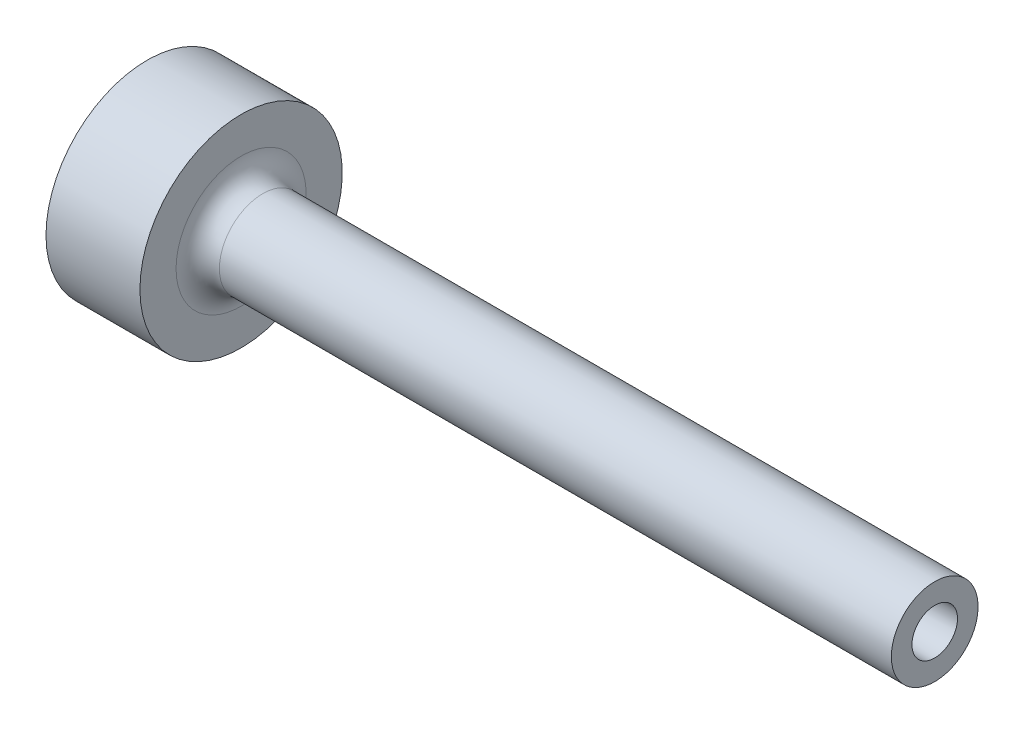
ISO-10303-21;
HEADER;
FILE_DESCRIPTION(('STEP AP214'),'2;1');
FILE_NAME('part.step','',(''),(''),'','','');
FILE_SCHEMA(('AUTOMOTIVE_DESIGN { 1 0 10303 214 1 1 1 1 }'));
ENDSEC;
DATA;
#1=APPLICATION_CONTEXT('core data for automotive mechanical design processes');
#2=APPLICATION_PROTOCOL_DEFINITION('international standard','automotive_design',2000,#1);
#3=PRODUCT_CONTEXT('',#1,'mechanical');
#4=PRODUCT('Part','Part','',(#3));
#5=PRODUCT_RELATED_PRODUCT_CATEGORY('part','',(#4));
#6=PRODUCT_DEFINITION_FORMATION('','',#4);
#7=PRODUCT_DEFINITION_CONTEXT('part definition',#1,'design');
#8=PRODUCT_DEFINITION('design','',#6,#7);
#9=PRODUCT_DEFINITION_SHAPE('','',#8);
#10=(LENGTH_UNIT() NAMED_UNIT(*) SI_UNIT(.MILLI.,.METRE.));
#11=(NAMED_UNIT(*) PLANE_ANGLE_UNIT() SI_UNIT($,.RADIAN.));
#12=(NAMED_UNIT(*) SI_UNIT($,.STERADIAN.) SOLID_ANGLE_UNIT());
#13=UNCERTAINTY_MEASURE_WITH_UNIT(LENGTH_MEASURE(1.E-05),#10,'distance_accuracy_value','');
#14=(GEOMETRIC_REPRESENTATION_CONTEXT(3) GLOBAL_UNCERTAINTY_ASSIGNED_CONTEXT((#13)) GLOBAL_UNIT_ASSIGNED_CONTEXT((#10,
#11,#12)) REPRESENTATION_CONTEXT('',''));
#15=CARTESIAN_POINT('',(0.,0.,0.));
#16=DIRECTION('',(0.,0.,1.));
#17=DIRECTION('',(1.,0.,0.));
#18=AXIS2_PLACEMENT_3D('',#15,#16,#17);
#19=CARTESIAN_POINT('',(0.,0.,0.));
#20=DIRECTION('',(-1.,0.,0.));
#21=DIRECTION('',(0.,0.,1.));
#22=AXIS2_PLACEMENT_3D('',#19,#20,#21);
#23=CYLINDRICAL_SURFACE('',#22,14.);
#24=CARTESIAN_POINT('',(13.,0.,0.));
#25=DIRECTION('',(-1.,0.,0.));
#26=DIRECTION('',(0.,0.,1.));
#27=AXIS2_PLACEMENT_3D('',#24,#25,#26);
#28=CIRCLE('',#27,14.);
#29=CARTESIAN_POINT('',(13.,0.,14.));
#30=VERTEX_POINT('',#29);
#31=EDGE_CURVE('E89',#30,#30,#28,.T.);
#32=ORIENTED_EDGE('',*,*,#31,.T.);
#33=EDGE_LOOP('',(#32));
#34=FACE_BOUND('',#33,.T.);
#35=CARTESIAN_POINT('',(0.,0.,0.));
#36=DIRECTION('',(-1.,0.,0.));
#37=DIRECTION('',(0.,0.,1.));
#38=AXIS2_PLACEMENT_3D('',#35,#36,#37);
#39=CIRCLE('',#38,14.);
#40=CARTESIAN_POINT('',(0.,0.,14.));
#41=VERTEX_POINT('',#40);
#42=EDGE_CURVE('E84',#41,#41,#39,.T.);
#43=ORIENTED_EDGE('',*,*,#42,.F.);
#44=EDGE_LOOP('',(#43));
#45=FACE_BOUND('',#44,.T.);
#46=CARTESIAN_POINT('',(6.5,-13.856406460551,-2.));
#47=CARTESIAN_POINT('',(6.61172417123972,-13.8564082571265,-1.99999534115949));
#48=CARTESIAN_POINT('',(6.72351471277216,-13.8577723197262,-1.99060664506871));
#49=CARTESIAN_POINT('',(6.9439746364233,-13.8630779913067,-1.95330740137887));
#50=CARTESIAN_POINT('',(7.05264079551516,-13.8670221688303,-1.92537839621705));
#51=CARTESIAN_POINT('',(7.26362870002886,-13.8770324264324,-1.85184738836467));
#52=CARTESIAN_POINT('',(7.36595507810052,-13.8830969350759,-1.80625847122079));
#53=CARTESIAN_POINT('',(7.56148972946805,-13.8966626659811,-1.69873175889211));
#54=CARTESIAN_POINT('',(7.65469934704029,-13.9041636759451,-1.63679637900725));
#55=CARTESIAN_POINT('',(7.83004829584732,-13.9198182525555,-1.49785346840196));
#56=CARTESIAN_POINT('',(7.91211171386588,-13.9279757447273,-1.42075056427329));
#57=CARTESIAN_POINT('',(8.06218155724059,-13.9439890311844,-1.25386707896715));
#58=CARTESIAN_POINT('',(8.13018723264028,-13.9518448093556,-1.16408582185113));
#59=CARTESIAN_POINT('',(8.25048909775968,-13.9664103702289,-0.973910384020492));
#60=CARTESIAN_POINT('',(8.30271571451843,-13.9731150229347,-0.873471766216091));
#61=CARTESIAN_POINT('',(8.38953073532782,-13.9845795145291,-0.665136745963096));
#62=CARTESIAN_POINT('',(8.4241199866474,-13.9893394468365,-0.557240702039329));
#63=CARTESIAN_POINT('',(8.47444920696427,-13.9963505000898,-0.337834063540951));
#64=CARTESIAN_POINT('',(8.49031606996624,-13.9986185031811,-0.226353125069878));
#65=CARTESIAN_POINT('',(8.5031438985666,-14.0004479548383,-0.00228956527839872));
#66=CARTESIAN_POINT('',(8.50010582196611,-14.0000095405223,0.110292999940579));
#67=CARTESIAN_POINT('',(8.47531062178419,-13.9964890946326,0.33249899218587));
#68=CARTESIAN_POINT('',(8.45369000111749,-13.9934263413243,0.442137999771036));
#69=CARTESIAN_POINT('',(8.39255744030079,-13.9850228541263,0.656215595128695));
#70=CARTESIAN_POINT('',(8.3530450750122,-13.9796820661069,0.760654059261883));
#71=CARTESIAN_POINT('',(8.25710925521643,-13.9672894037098,0.961781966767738));
#72=CARTESIAN_POINT('',(8.20062784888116,-13.9602316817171,1.05844339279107));
#73=CARTESIAN_POINT('',(8.07239950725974,-13.9451926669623,1.24096782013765));
#74=CARTESIAN_POINT('',(8.00065165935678,-13.9372113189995,1.32683017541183));
#75=CARTESIAN_POINT('',(7.843165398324,-13.921132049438,1.48612299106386));
#76=CARTESIAN_POINT('',(7.75730786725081,-13.9130337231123,1.55943569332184));
#77=CARTESIAN_POINT('',(7.57444547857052,-13.8977029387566,1.69062989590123));
#78=CARTESIAN_POINT('',(7.47744056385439,-13.890470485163,1.74851131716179));
#79=CARTESIAN_POINT('',(7.27491971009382,-13.8776905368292,1.84721301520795));
#80=CARTESIAN_POINT('',(7.1693981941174,-13.8721441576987,1.88802200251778));
#81=CARTESIAN_POINT('',(6.95290242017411,-13.8633846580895,1.9513062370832));
#82=CARTESIAN_POINT('',(6.84192850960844,-13.8601713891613,1.97378265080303));
#83=CARTESIAN_POINT('',(6.61872346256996,-13.8564698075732,1.99960390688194));
#84=CARTESIAN_POINT('',(6.50651197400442,-13.8559577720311,2.00311531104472));
#85=CARTESIAN_POINT('',(6.28310219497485,-13.8576537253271,1.9913480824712));
#86=CARTESIAN_POINT('',(6.17190387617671,-13.8598616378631,1.9760699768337));
#87=CARTESIAN_POINT('',(5.95418781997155,-13.8667269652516,1.92729837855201));
#88=CARTESIAN_POINT('',(5.84765127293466,-13.8713733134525,1.8938871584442));
#89=CARTESIAN_POINT('',(5.6416912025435,-13.8825829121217,1.80988306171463));
#90=CARTESIAN_POINT('',(5.54226800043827,-13.8891462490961,1.75928940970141));
#91=CARTESIAN_POINT('',(5.35260812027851,-13.9035064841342,1.64195360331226));
#92=CARTESIAN_POINT('',(5.26243903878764,-13.911311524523,1.57510320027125));
#93=CARTESIAN_POINT('',(5.09454027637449,-13.9272509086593,1.42730277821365));
#94=CARTESIAN_POINT('',(5.01681123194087,-13.9353852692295,1.34635203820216));
#95=CARTESIAN_POINT('',(4.8754047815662,-13.9511405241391,1.17191708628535));
#96=CARTESIAN_POINT('',(4.81183747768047,-13.9587570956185,1.07834317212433));
#97=CARTESIAN_POINT('',(4.70132443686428,-13.972552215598,0.881748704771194));
#98=CARTESIAN_POINT('',(4.65437828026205,-13.9787308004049,0.778728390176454));
#99=CARTESIAN_POINT('',(4.57861788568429,-13.9889347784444,0.566515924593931));
#100=CARTESIAN_POINT('',(4.54974241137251,-13.9929674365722,0.457345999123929));
#101=CARTESIAN_POINT('',(4.51074453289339,-13.9984555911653,0.235645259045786));
#102=CARTESIAN_POINT('',(4.50062101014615,-13.9999112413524,0.123114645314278));
#103=CARTESIAN_POINT('',(4.49943976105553,-14.0000800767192,-0.101043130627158));
#104=CARTESIAN_POINT('',(4.50821318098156,-13.998817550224,-0.212669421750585));
#105=CARTESIAN_POINT('',(4.54421615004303,-13.9937406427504,-0.432842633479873));
#106=CARTESIAN_POINT('',(4.57144565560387,-13.989926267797,-0.541389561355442));
#107=CARTESIAN_POINT('',(4.6435299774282,-13.9801722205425,-0.752283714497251));
#108=CARTESIAN_POINT('',(4.68837418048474,-13.9742338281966,-0.854634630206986));
#109=CARTESIAN_POINT('',(4.79439714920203,-13.960885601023,-1.05038570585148));
#110=CARTESIAN_POINT('',(4.8555763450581,-13.9534757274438,-1.14378562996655));
#111=CARTESIAN_POINT('',(4.99314771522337,-13.9379304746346,-1.31984194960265));
#112=CARTESIAN_POINT('',(5.06966490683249,-13.9297894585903,-1.40240016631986));
#113=CARTESIAN_POINT('',(5.2354775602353,-13.9137422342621,-1.55356716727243));
#114=CARTESIAN_POINT('',(5.32477602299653,-13.9058360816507,-1.6221726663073));
#115=CARTESIAN_POINT('',(5.51414543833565,-13.8911108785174,-1.74379523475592));
#116=CARTESIAN_POINT('',(5.61426869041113,-13.8842975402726,-1.79673154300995));
#117=CARTESIAN_POINT('',(5.82203229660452,-13.8725962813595,-1.88495902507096));
#118=CARTESIAN_POINT('',(5.92966459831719,-13.8677063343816,-1.92026877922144));
#119=CARTESIAN_POINT('',(6.11483642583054,-13.8615529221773,-1.96409255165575));
#120=CARTESIAN_POINT('',(6.19122433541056,-13.859633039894,-1.97753762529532));
#121=CARTESIAN_POINT('',(6.34506419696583,-13.857059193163,-1.99549291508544));
#122=CARTESIAN_POINT('',(6.42251613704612,-13.8564052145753,-2.00000323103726));
#123=CARTESIAN_POINT('',(6.5,-13.856406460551,-2.));
#124=B_SPLINE_CURVE_WITH_KNOTS('',3,(#46,#47,#48,#49,#50,#51,#52,#53,#54,#55,#56,#57,#58,#59,
#60,#61,#62,#63,#64,#65,#66,#67,#68,#69,#70,#71,#72,#73,#74,#75,#76,#77,#78,#79,#80,#81,#82,#83,
#84,#85,#86,#87,#88,#89,#90,#91,#92,#93,#94,#95,#96,#97,#98,#99,#100,#101,#102,#103,#104,#105,
#106,#107,#108,#109,#110,#111,#112,#113,#114,#115,#116,#117,#118,#119,#120,#121,#122,#123),
.UNSPECIFIED.,.T.,.F.,(4,2,2,2,2,2,2,2,2,2,2,2,2,2,2,2,2,2,2,2,2,2,2,2,2,2,2,2,2,2,2,2,2,2,2,2,
2,2,4),(0.,0.334889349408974,0.670112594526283,1.00508792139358,1.34001378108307,
1.6771171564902,2.01423851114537,2.35282530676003,2.6913958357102,3.02765822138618,
3.36390357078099,3.69769984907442,4.03150405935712,4.36646147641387,4.70143892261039,
5.03940517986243,5.37737316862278,5.7155642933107,6.05373389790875,6.3889286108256,
6.72411392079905,7.05779100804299,7.39148315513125,7.72746121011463,8.06345644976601,
8.40197921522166,8.74049343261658,9.07785422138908,9.41519488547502,9.74953375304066,
10.083871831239,10.4180087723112,10.7521545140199,11.0891434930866,11.426211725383,
11.7649881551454,12.103406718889,12.3356645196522,12.5679197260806),.UNSPECIFIED.);
#125=CARTESIAN_POINT('',(6.5,-13.856406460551,-2.));
#126=VERTEX_POINT('',#125);
#127=EDGE_CURVE('E10',#126,#126,#124,.T.);
#128=ORIENTED_EDGE('',*,*,#127,.F.);
#129=EDGE_LOOP('',(#128));
#130=FACE_BOUND('',#129,.T.);
#131=ADVANCED_FACE('F16',(#34,#45,#130),#23,.T.);
#132=CARTESIAN_POINT('',(0.,0.,0.));
#133=DIRECTION('',(1.,0.,0.));
#134=DIRECTION('',(0.,0.,-1.));
#135=AXIS2_PLACEMENT_3D('',#132,#133,#134);
#136=CONICAL_SURFACE('',#135,1.25,0.0174532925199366);
#137=CARTESIAN_POINT('',(109.,0.,0.));
#138=DIRECTION('',(-1.,0.,0.));
#139=DIRECTION('',(0.,0.,1.));
#140=AXIS2_PLACEMENT_3D('',#137,#138,#139);
#141=CIRCLE('',#140,3.15260207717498);
#142=CARTESIAN_POINT('',(109.,0.,3.15260207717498));
#143=VERTEX_POINT('',#142);
#144=EDGE_CURVE('E81',#143,#143,#141,.T.);
#145=ORIENTED_EDGE('',*,*,#144,.F.);
#146=EDGE_LOOP('',(#145));
#147=FACE_BOUND('',#146,.T.);
#148=CARTESIAN_POINT('',(0.924407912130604,0.,0.));
#149=DIRECTION('',(-1.,0.,0.));
#150=DIRECTION('',(0.,0.,1.));
#151=AXIS2_PLACEMENT_3D('',#148,#149,#150);
#152=CIRCLE('',#151,1.26613560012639);
#153=CARTESIAN_POINT('',(0.924407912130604,0.,1.26613560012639));
#154=VERTEX_POINT('',#153);
#155=EDGE_CURVE('E94',#154,#154,#152,.F.);
#156=ORIENTED_EDGE('',*,*,#155,.F.);
#157=EDGE_LOOP('',(#156));
#158=FACE_BOUND('',#157,.T.);
#159=ADVANCED_FACE('F45',(#147,#158),#136,.F.);
#160=CARTESIAN_POINT('',(16.,0.,0.));
#161=DIRECTION('',(-1.,0.,0.));
#162=DIRECTION('',(0.,0.,1.));
#163=AXIS2_PLACEMENT_3D('',#160,#161,#162);
#164=TOROIDAL_SURFACE('',#163,9.,3.);
#165=CARTESIAN_POINT('',(13.,0.,0.));
#166=DIRECTION('',(-1.,0.,0.));
#167=DIRECTION('',(0.,0.,1.));
#168=AXIS2_PLACEMENT_3D('',#165,#166,#167);
#169=CIRCLE('',#168,9.);
#170=CARTESIAN_POINT('',(13.,0.,9.));
#171=VERTEX_POINT('',#170);
#172=EDGE_CURVE('E91',#171,#171,#169,.T.);
#173=ORIENTED_EDGE('',*,*,#172,.F.);
#174=EDGE_LOOP('',(#173));
#175=FACE_BOUND('',#174,.T.);
#176=CARTESIAN_POINT('',(16.,0.,0.));
#177=DIRECTION('',(-1.,0.,0.));
#178=DIRECTION('',(0.,0.,1.));
#179=AXIS2_PLACEMENT_3D('',#176,#177,#178);
#180=CIRCLE('',#179,6.);
#181=CARTESIAN_POINT('',(16.,0.,6.));
#182=VERTEX_POINT('',#181);
#183=EDGE_CURVE('E28',#182,#182,#180,.T.);
#184=ORIENTED_EDGE('',*,*,#183,.T.);
#185=EDGE_LOOP('',(#184));
#186=FACE_BOUND('',#185,.T.);
#187=ADVANCED_FACE('F18',(#175,#186),#164,.F.);
#188=CARTESIAN_POINT('',(0.,0.,0.));
#189=DIRECTION('',(-1.,0.,0.));
#190=DIRECTION('',(0.,0.,1.));
#191=AXIS2_PLACEMENT_3D('',#188,#189,#190);
#192=CYLINDRICAL_SURFACE('',#191,6.);
#193=ORIENTED_EDGE('',*,*,#183,.F.);
#194=EDGE_LOOP('',(#193));
#195=FACE_BOUND('',#194,.T.);
#196=CARTESIAN_POINT('',(109.,0.,0.));
#197=DIRECTION('',(-1.,0.,0.));
#198=DIRECTION('',(0.,0.,1.));
#199=AXIS2_PLACEMENT_3D('',#196,#197,#198);
#200=CIRCLE('',#199,6.);
#201=CARTESIAN_POINT('',(109.,0.,6.));
#202=VERTEX_POINT('',#201);
#203=EDGE_CURVE('E80',#202,#202,#200,.T.);
#204=ORIENTED_EDGE('',*,*,#203,.T.);
#205=EDGE_LOOP('',(#204));
#206=FACE_BOUND('',#205,.T.);
#207=ADVANCED_FACE('F66',(#195,#206),#192,.T.);
#208=CARTESIAN_POINT('',(109.,6.,0.));
#209=DIRECTION('',(-1.,0.,0.));
#210=DIRECTION('',(0.,0.,1.));
#211=AXIS2_PLACEMENT_3D('',#208,#209,#210);
#212=PLANE('',#211);
#213=ORIENTED_EDGE('',*,*,#203,.F.);
#214=EDGE_LOOP('',(#213));
#215=FACE_BOUND('',#214,.T.);
#216=ORIENTED_EDGE('',*,*,#144,.T.);
#217=EDGE_LOOP('',(#216));
#218=FACE_BOUND('',#217,.T.);
#219=ADVANCED_FACE('F62',(#215,#218),#212,.F.);
#220=CARTESIAN_POINT('',(0.,1.25,0.));
#221=DIRECTION('',(1.,0.,0.));
#222=DIRECTION('',(0.,0.,-1.));
#223=AXIS2_PLACEMENT_3D('',#220,#221,#222);
#224=PLANE('',#223);
#225=CARTESIAN_POINT('',(0.,0.,0.));
#226=DIRECTION('',(-1.,0.,0.));
#227=DIRECTION('',(0.,0.,1.));
#228=AXIS2_PLACEMENT_3D('',#225,#226,#227);
#229=CIRCLE('',#228,5.);
#230=CARTESIAN_POINT('',(0.,0.,5.));
#231=VERTEX_POINT('',#230);
#232=EDGE_CURVE('E97',#231,#231,#229,.T.);
#233=ORIENTED_EDGE('',*,*,#232,.F.);
#234=EDGE_LOOP('',(#233));
#235=FACE_BOUND('',#234,.T.);
#236=ORIENTED_EDGE('',*,*,#42,.T.);
#237=EDGE_LOOP('',(#236));
#238=FACE_BOUND('',#237,.T.);
#239=ADVANCED_FACE('F60',(#235,#238),#224,.F.);
#240=CARTESIAN_POINT('',(13.,14.,0.));
#241=DIRECTION('',(-1.,0.,0.));
#242=DIRECTION('',(0.,0.,1.));
#243=AXIS2_PLACEMENT_3D('',#240,#241,#242);
#244=PLANE('',#243);
#245=ORIENTED_EDGE('',*,*,#31,.F.);
#246=EDGE_LOOP('',(#245));
#247=FACE_BOUND('',#246,.T.);
#248=ORIENTED_EDGE('',*,*,#172,.T.);
#249=EDGE_LOOP('',(#248));
#250=FACE_BOUND('',#249,.T.);
#251=ADVANCED_FACE('F58',(#247,#250),#244,.F.);
#252=CARTESIAN_POINT('',(-14.4672767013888,0.,0.));
#253=DIRECTION('',(-1.,0.,0.));
#254=DIRECTION('',(0.,0.,1.));
#255=AXIS2_PLACEMENT_3D('',#252,#253,#254);
#256=DEGENERATE_TOROIDAL_SURFACE('',#255,0.56308411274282,15.5,.F.);
#257=ORIENTED_EDGE('',*,*,#232,.T.);
#258=EDGE_LOOP('',(#257));
#259=FACE_BOUND('',#258,.T.);
#260=ORIENTED_EDGE('',*,*,#155,.T.);
#261=EDGE_LOOP('',(#260));
#262=FACE_BOUND('',#261,.T.);
#263=ADVANCED_FACE('F41',(#259,#262),#256,.T.);
#264=CARTESIAN_POINT('',(6.5,-14.,0.));
#265=DIRECTION('',(0.,-1.,0.));
#266=DIRECTION('',(0.,0.,-1.));
#267=AXIS2_PLACEMENT_3D('',#264,#265,#266);
#268=CYLINDRICAL_SURFACE('',#267,2.);
#269=CARTESIAN_POINT('',(6.5,-8.,0.));
#270=DIRECTION('',(0.,-1.,0.));
#271=DIRECTION('',(0.,0.,-1.));
#272=AXIS2_PLACEMENT_3D('',#269,#270,#271);
#273=CIRCLE('',#272,2.);
#274=CARTESIAN_POINT('',(6.5,-8.,-2.));
#275=VERTEX_POINT('',#274);
#276=EDGE_CURVE('E100',#275,#275,#273,.T.);
#277=ORIENTED_EDGE('',*,*,#276,.F.);
#278=EDGE_LOOP('',(#277));
#279=FACE_BOUND('',#278,.T.);
#280=ORIENTED_EDGE('',*,*,#127,.T.);
#281=EDGE_LOOP('',(#280));
#282=FACE_BOUND('',#281,.T.);
#283=ADVANCED_FACE('F33',(#279,#282),#268,.F.);
#284=CARTESIAN_POINT('',(6.5,-6.84529946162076,0.));
#285=DIRECTION('',(0.,-1.,0.));
#286=DIRECTION('',(0.,0.,-1.));
#287=AXIS2_PLACEMENT_3D('',#284,#285,#286);
#288=CONICAL_SURFACE('',#287,0.,1.0471975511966);
#289=ORIENTED_EDGE('',*,*,#276,.T.);
#290=EDGE_LOOP('',(#289));
#291=FACE_BOUND('',#290,.T.);
#292=CARTESIAN_POINT('',(6.5,-6.84529946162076,0.));
#293=VERTEX_POINT('',#292);
#294=VERTEX_LOOP('',#293);
#295=FACE_BOUND('',#294,.T.);
#296=ADVANCED_FACE('F31',(#291,#295),#288,.F.);
#297=CLOSED_SHELL('',(#131,#159,#187,#207,#219,#239,#251,#263,#283,#296));
#298=MANIFOLD_SOLID_BREP('B1',#297);
#299=ADVANCED_BREP_SHAPE_REPRESENTATION('',(#18,#298),#14);
#300=SHAPE_DEFINITION_REPRESENTATION(#9,#299);
ENDSEC;
END-ISO-10303-21;
